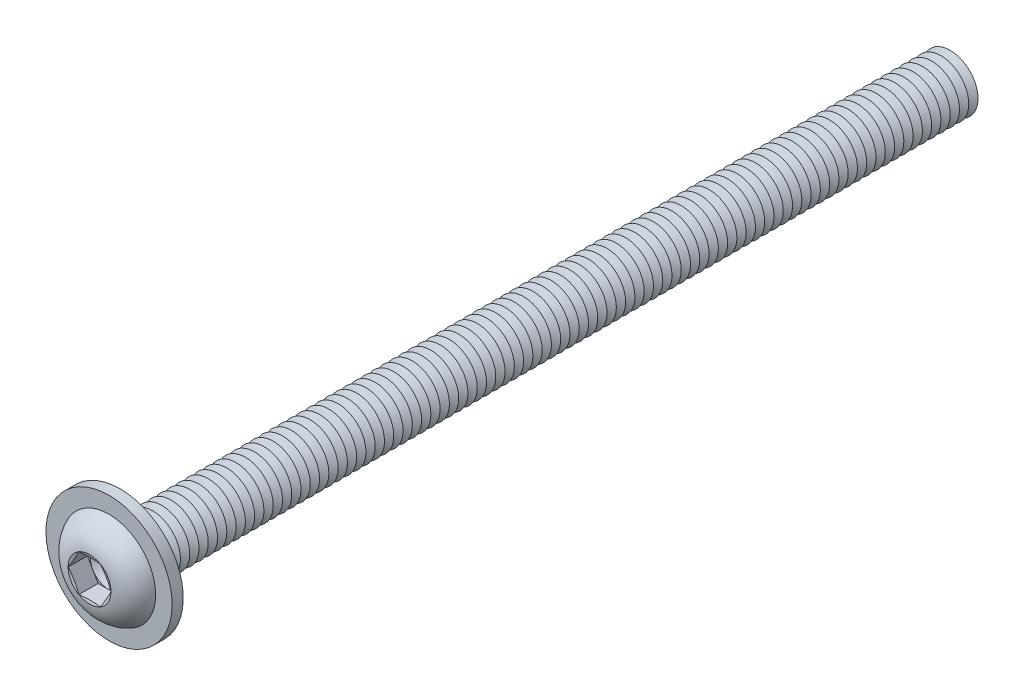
from build123d import *

# Parameters (mm, degrees)
FILLET1_R           = 0.5
LPATTERN1_COUNT     = 90
LPATTERN1_PITCH     = 1
CUT_EXTRUDE1_DEPTH  = 2.08
SKETCH5_R           = 6.8
SKETCH5_R_2         = 3.5
BOSS_EXTRUDE1_DEPTH = 1.2


with BuildPart() as part:
    # Sketch1 → Revolve1 (revolve)
    with BuildSketch(Plane(origin=(0, 0, 0), x_dir=(0, 0, -1), z_dir=(1, 0, 0))):
        with BuildLine():
            Line((0, 3), (0, 5.25))
            ThreePointArc((0, 5.25), (-2.210041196, 4.408189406), (-3.3, 2.3094))
            Line((-3.3, 2.3094), (-2.990599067, 1.1547))
            Line((-2.990599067, 1.1547), (-3.3, 1.1547))
            Line((-3.3, 1.1547), (-3.3, 0))
            Line((-3.3, 0), (90, 0))
            Line((90, 0), (90, 3))
            Line((90, 3), (0, 3))
        make_face()
    revolve(axis=Axis((0, 0, -90), (0, 0, 1)))

    # Fillet1
    fillet1_edges = [part.edges().sort_by_distance(p)[0] for p in [
        (0, -3, 0),
    ]]
    fillet(fillet1_edges, radius=FILLET1_R)

    # Sketch2 → Cut-Revolve1 (revolve, cut)
    with BuildSketch(Plane(origin=(0, 0, 0), x_dir=(0, 0, -1), z_dir=(1, 0, 0))):
        Polygon((89.5, 3), (90.5, 3), (90, 2.133974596), align=None)
    cut_revolve1 = revolve(axis=Axis((0, 0, -90), (0, 0, -1)), mode=Mode.SUBTRACT)

    # LPattern1: Cut-Revolve1 ×90
    with Locations(*[(0, 0, i * LPATTERN1_PITCH) for i in range(1, LPATTERN1_COUNT)]):
        add(cut_revolve1, mode=Mode.SUBTRACT)

    # Sketch3 → Cut-Extrude1 (cut)
    with BuildSketch(Plane.XY.offset(3.3)):
        Polygon((1.1547, 1.999999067), (-1.1547, 1.999999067), (-2.3094, 0), (-1.1547, -1.999999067), (1.1547, -1.999999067), (2.3094, 0), align=None)
    extrude(amount=-CUT_EXTRUDE1_DEPTH, mode=Mode.SUBTRACT)

    # Cut-Extrude2 cone 1 section (on through the dimple's axis) → Cut-Extrude2 (revolve, cut)
    with BuildSketch(Plane(origin=(0, 0, 1.22), x_dir=(0, -1, 0), z_dir=(1, 0, 0))):
        Polygon((0, 0), (1.999999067, 0), (0, 1.1547), align=None)
    revolve(axis=Axis((0, 0, 1.22), (0, 0, -1)), mode=Mode.SUBTRACT)

    # Sketch5 → Boss-Extrude1 (add)
    with BuildSketch(Plane(origin=(0, 0, 0), x_dir=(-1, 0, 0), z_dir=(0, 0, -1))):
        with Locations(Location((0, 0, 0), (0, 0, 90))):
            Circle(SKETCH5_R)
        Circle(SKETCH5_R_2, mode=Mode.SUBTRACT)
    extrude(amount=-BOSS_EXTRUDE1_DEPTH)


solid = part.part
